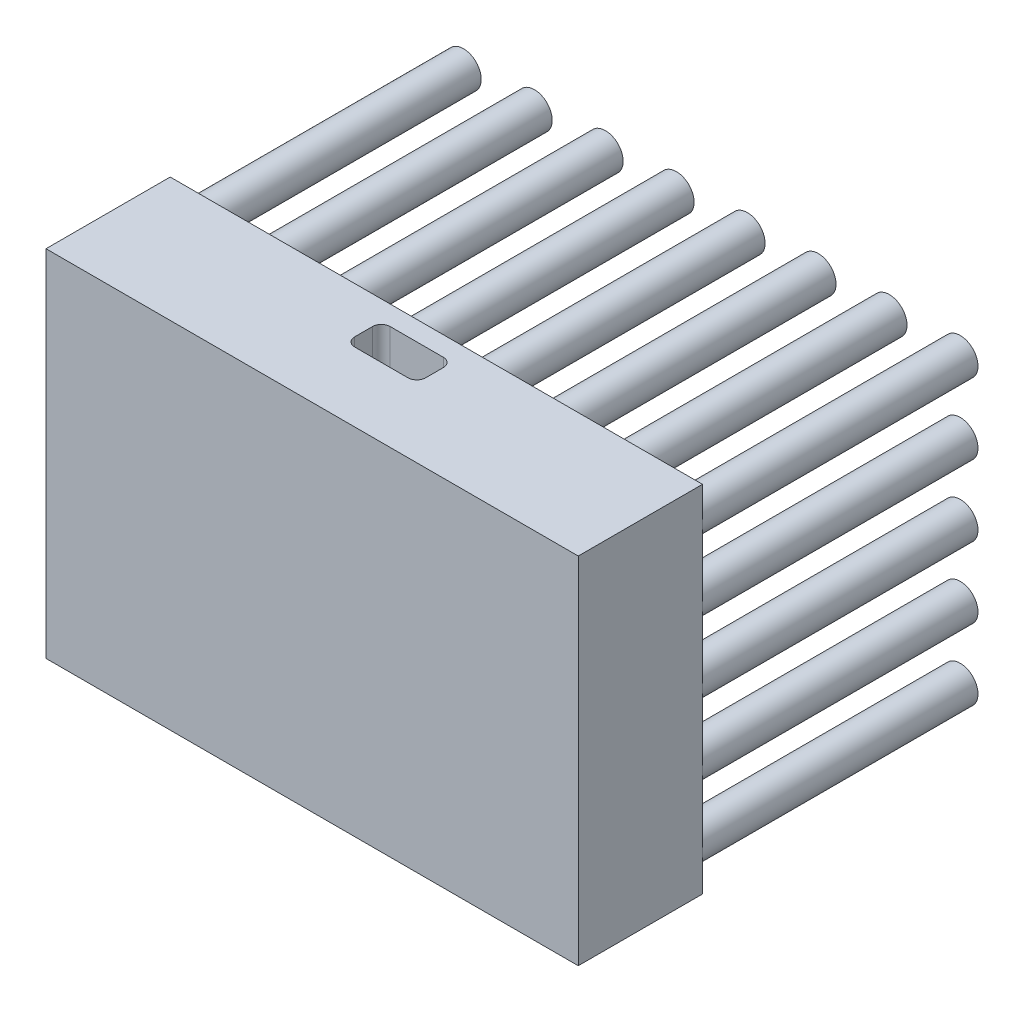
from build123d import *

# Parameters (mm, degrees)
SKETCH_1_W          = 30
SKETCH_1_H          = 20
EXTRUDE_1_DEPTH     = 7
SKETCH_2_R          = 1
EXTRUDE_2_DEPTH     = 15.53
SKETCH_3_W          = 4
SKETCH_3_H          = 2
CUT_EXTRUDE_1_DEPTH = 20
FILLET_1_R          = 0.5
FILLET_2_R          = 0.5


with BuildPart() as part:
    # Sketch 1 → Extrude 1 (new body)
    with BuildSketch(Plane.XY):
        with Locations((-15, 10)):
            Rectangle(SKETCH_1_W, SKETCH_1_H)
    extrude(amount=EXTRUDE_1_DEPTH)

    # Sketch 2 → Extrude 2 (add)
    with BuildSketch(Plane(origin=(0, 0, 0), x_dir=(-1, 0, 0), z_dir=(0, 0, -1))):
        with Locations(Location((1, 2, 0), (0, 0, 180))):
            Circle(SKETCH_2_R)
        with Locations(Location((5, 2, 0), (0, 0, 180))):
            Circle(SKETCH_2_R)
        with Locations(Location((9, 2, 0), (0, 0, 180))):
            Circle(SKETCH_2_R)
        with Locations(Location((13, 2, 0), (0, 0, 180))):
            Circle(SKETCH_2_R)
        with Locations(Location((17, 2, 0), (0, 0, 180))):
            Circle(SKETCH_2_R)
        with Locations(Location((21, 2, 0), (0, 0, 180))):
            Circle(SKETCH_2_R)
        with Locations(Location((25, 2, 0), (0, 0, 180))):
            Circle(SKETCH_2_R)
        with Locations((29, 2)):
            Circle(SKETCH_2_R)
        with Locations(Location((1, 6, 0), (0, 0, 180))):
            Circle(SKETCH_2_R)
        with Locations(Location((1, 10, 0), (0, 0, 180))):
            Circle(SKETCH_2_R)
        with Locations(Location((1, 14, 0), (0, 0, 180))):
            Circle(SKETCH_2_R)
        with Locations(Location((1, 18, 0), (0, 0, 180))):
            Circle(SKETCH_2_R)
        with Locations(Location((5, 18, 0), (0, 0, 180))):
            Circle(SKETCH_2_R)
        with Locations(Location((5, 14, 0), (0, 0, 180))):
            Circle(SKETCH_2_R)
        with Locations(Location((5, 10, 0), (0, 0, 180))):
            Circle(SKETCH_2_R)
        with Locations(Location((5, 6, 0), (0, 0, 180))):
            Circle(SKETCH_2_R)
        with Locations(Location((9, 18, 0), (0, 0, 180))):
            Circle(SKETCH_2_R)
        with Locations(Location((9, 14, 0), (0, 0, 180))):
            Circle(SKETCH_2_R)
        with Locations(Location((9, 10, 0), (0, 0, 180))):
            Circle(SKETCH_2_R)
        with Locations(Location((9, 6, 0), (0, 0, 180))):
            Circle(SKETCH_2_R)
        with Locations(Location((13, 18, 0), (0, 0, 180))):
            Circle(SKETCH_2_R)
        with Locations(Location((13, 14, 0), (0, 0, 180))):
            Circle(SKETCH_2_R)
        with Locations(Location((13, 10, 0), (0, 0, 180))):
            Circle(SKETCH_2_R)
        with Locations(Location((13, 6, 0), (0, 0, 180))):
            Circle(SKETCH_2_R)
        with Locations(Location((17, 18, 0), (0, 0, 180))):
            Circle(SKETCH_2_R)
        with Locations(Location((17, 14, 0), (0, 0, 180))):
            Circle(SKETCH_2_R)
        with Locations(Location((17, 10, 0), (0, 0, 180))):
            Circle(SKETCH_2_R)
        with Locations(Location((17, 6, 0), (0, 0, 180))):
            Circle(SKETCH_2_R)
        with Locations(Location((21, 18, 0), (0, 0, 180))):
            Circle(SKETCH_2_R)
        with Locations(Location((21, 14, 0), (0, 0, 180))):
            Circle(SKETCH_2_R)
        with Locations(Location((21, 10, 0), (0, 0, 180))):
            Circle(SKETCH_2_R)
        with Locations(Location((21, 6, 0), (0, 0, 180))):
            Circle(SKETCH_2_R)
        with Locations(Location((25, 18, 0), (0, 0, 180))):
            Circle(SKETCH_2_R)
        with Locations(Location((25, 14, 0), (0, 0, 180))):
            Circle(SKETCH_2_R)
        with Locations(Location((25, 10, 0), (0, 0, 180))):
            Circle(SKETCH_2_R)
        with Locations(Location((25, 6, 0), (0, 0, 180))):
            Circle(SKETCH_2_R)
        with Locations((29, 18)):
            Circle(SKETCH_2_R)
        with Locations((29, 14)):
            Circle(SKETCH_2_R)
        with Locations((29, 10)):
            Circle(SKETCH_2_R)
        with Locations((29, 6)):
            Circle(SKETCH_2_R)
    extrude(amount=EXTRUDE_2_DEPTH)

    # Sketch 3 → Cut-Extrude 1 (cut)
    with BuildSketch(Plane(origin=(0, 0, 0), x_dir=(-1, 0, 0), z_dir=(0, -1, 0))):
        with Locations((15, -2.1)):
            Rectangle(SKETCH_3_W, SKETCH_3_H)
    extrude(amount=-CUT_EXTRUDE_1_DEPTH, mode=Mode.SUBTRACT)

    # Fillet 1
    fillet_1_edges = [part.edges().sort_by_distance(p)[0] for p in [
        (-13, 10, 1.1),
    ]]
    fillet(fillet_1_edges, radius=FILLET_1_R)

    # Fillet 2
    fillet_2_edges = [part.edges().sort_by_distance(p)[0] for p in [
        (-13, 10, 3.1),
        (-17, 10, 1.1),
        (-17, 10, 3.1),
    ]]
    fillet(fillet_2_edges, radius=FILLET_2_R)


solid = part.part
